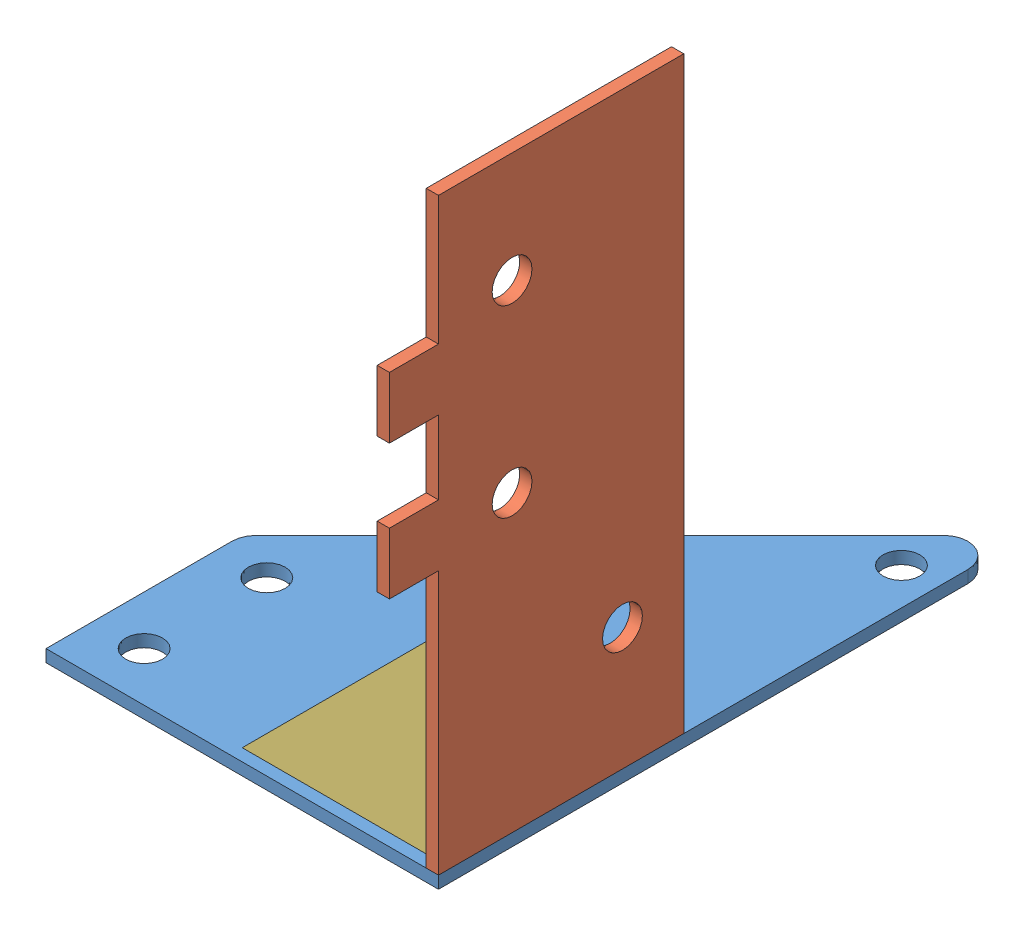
SolidWorks assembly 2 Prong Base Half.SLDASM, configuration Default (file format 10000). Lengths in mm.
Overall size (203.2 311.15 312.17).
3 component instances, 3 part files, 6 mates.
Components (placement in the parent):
- Base Bottom-1: Base Bottom.SLDPRT [Default] at (180.6042 130.9663 388.8322) size (203.2 6.35 286.77)
- Prototype Base 2 Prong-1: Prototype Base 2 Prong.SLDPRT [Default] at (180.6042 137.3163 261.8322) x (0 0 1) z (-1 0 0) size (152.4 304.8 6.35)
- Base Plate Gusset-1: Base Plate Gusset.SLDPRT [Default] at (174.2542 137.3163 382.4822) x (-1 0 0) z (0 0 -1) size (101.6 101.6 6.35)
Mates (geometry in assembly coordinates):
- Coincident1: coincident anti-aligned: plane of Base Bottom-1 through (-9.8958 137.3163 292.5662) normal (0 1 0); plane of Prototype Base 2 Prong-1 through (174.2542 137.3163 261.8322) normal (0 -1 0)
- Coincident2: coincident aligned: plane of Base Bottom-1 through (-22.5958 137.3163 388.8322) normal (0 0 1); plane of Prototype Base 2 Prong-1 through (174.2542 137.3163 388.8322) normal (0 0 1)
- Coincident3: coincident aligned: plane of Base Bottom-1 through (180.6042 137.3163 388.8322) normal (1 0 0); plane of Prototype Base 2 Prong-1 through (180.6042 137.3163 261.8322) normal (1 0 0)
- Coincident4: coincident anti-aligned: plane of Prototype Base 2 Prong-1 through (174.2542 137.3163 261.8322) normal (-1 0 0); plane of Base Plate Gusset-1 through (174.2542 238.9163 376.1322) normal (1 0 0)
- Coincident5: coincident anti-aligned: plane of Base Bottom-1 through (-9.8958 137.3163 292.5662) normal (0 1 0); plane of Base Plate Gusset-1 through (174.2542 137.3163 376.1322) normal (0 -1 0)
- Distance1: distance = 6.35 mm aligned: plane of Base Bottom-1 through (-22.5958 137.3163 388.8322) normal (0 0 1); plane of Base Plate Gusset-1 through (174.2542 137.3163 382.4822) normal (0 0 1)
